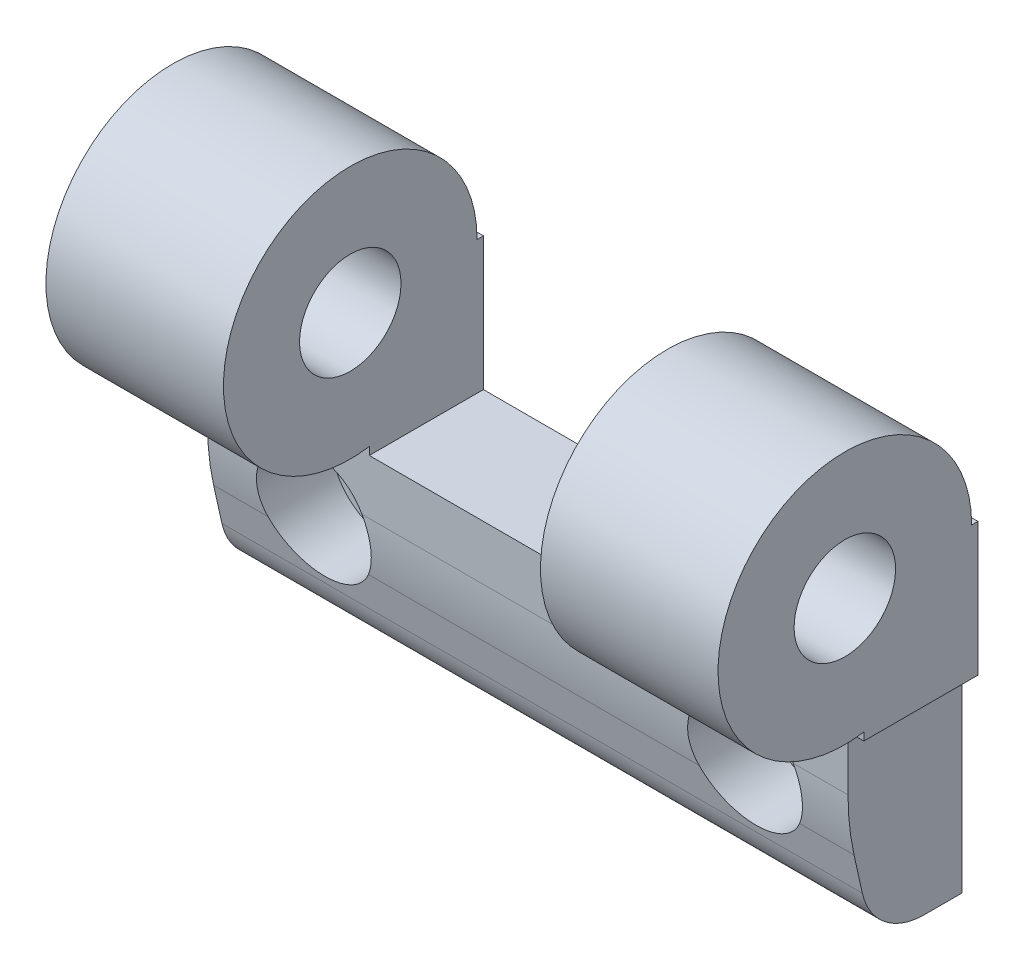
ISO-10303-21;
HEADER;
FILE_DESCRIPTION(('STEP AP214'),'2;1');
FILE_NAME('part.step','',(''),(''),'','','');
FILE_SCHEMA(('AUTOMOTIVE_DESIGN { 1 0 10303 214 1 1 1 1 }'));
ENDSEC;
DATA;
#1=APPLICATION_CONTEXT('core data for automotive mechanical design processes');
#2=APPLICATION_PROTOCOL_DEFINITION('international standard','automotive_design',2000,#1);
#3=PRODUCT_CONTEXT('',#1,'mechanical');
#4=PRODUCT('Part','Part','',(#3));
#5=PRODUCT_RELATED_PRODUCT_CATEGORY('part','',(#4));
#6=PRODUCT_DEFINITION_FORMATION('','',#4);
#7=PRODUCT_DEFINITION_CONTEXT('part definition',#1,'design');
#8=PRODUCT_DEFINITION('design','',#6,#7);
#9=PRODUCT_DEFINITION_SHAPE('','',#8);
#10=(LENGTH_UNIT() NAMED_UNIT(*) SI_UNIT(.MILLI.,.METRE.));
#11=(NAMED_UNIT(*) PLANE_ANGLE_UNIT() SI_UNIT($,.RADIAN.));
#12=(NAMED_UNIT(*) SI_UNIT($,.STERADIAN.) SOLID_ANGLE_UNIT());
#13=UNCERTAINTY_MEASURE_WITH_UNIT(LENGTH_MEASURE(1.E-05),#10,'distance_accuracy_value','');
#14=(GEOMETRIC_REPRESENTATION_CONTEXT(3) GLOBAL_UNCERTAINTY_ASSIGNED_CONTEXT((#13)) GLOBAL_UNIT_ASSIGNED_CONTEXT((#10,
#11,#12)) REPRESENTATION_CONTEXT('',''));
#15=CARTESIAN_POINT('',(0.,0.,0.));
#16=DIRECTION('',(0.,0.,1.));
#17=DIRECTION('',(1.,0.,0.));
#18=AXIS2_PLACEMENT_3D('',#15,#16,#17);
#19=CARTESIAN_POINT('',(-9.5,2.19544457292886,-11.));
#20=DIRECTION('',(1.,0.,0.));
#21=DIRECTION('',(0.,1.,0.));
#22=AXIS2_PLACEMENT_3D('',#19,#20,#21);
#23=CYLINDRICAL_SURFACE('',#22,20.);
#24=CARTESIAN_POINT('',(3.95687320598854,-2.1431645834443,8.52374120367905));
#25=CARTESIAN_POINT('',(4.01660703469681,-2.03290070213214,8.54825287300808));
#26=CARTESIAN_POINT('',(4.07175599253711,-1.92005304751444,8.57234171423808));
#27=CARTESIAN_POINT('',(4.17252019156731,-1.68992066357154,8.6193180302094));
#28=CARTESIAN_POINT('',(4.21813419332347,-1.57263535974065,8.64220534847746));
#29=CARTESIAN_POINT('',(4.29943126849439,-1.33443853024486,8.68640682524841));
#30=CARTESIAN_POINT('',(4.33511861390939,-1.21352858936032,8.70772165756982));
#31=CARTESIAN_POINT('',(4.39627456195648,-0.968849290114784,8.74848394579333));
#32=CARTESIAN_POINT('',(4.42174380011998,-0.845080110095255,8.7679315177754));
#33=CARTESIAN_POINT('',(4.46224845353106,-0.595295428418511,8.804740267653));
#34=CARTESIAN_POINT('',(4.47726432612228,-0.469276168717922,8.82209748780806));
#35=CARTESIAN_POINT('',(4.49659922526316,-0.216123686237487,8.85448616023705));
#36=CARTESIAN_POINT('',(4.5009184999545,-0.0889904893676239,8.86951766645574));
#37=CARTESIAN_POINT('',(4.49875711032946,0.165403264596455,8.89711776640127));
#38=CARTESIAN_POINT('',(4.49228061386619,0.29266375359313,8.90968730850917));
#39=CARTESIAN_POINT('',(4.46852718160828,0.546337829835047,8.93230178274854));
#40=CARTESIAN_POINT('',(4.45125551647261,0.672751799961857,8.94234794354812));
#41=CARTESIAN_POINT('',(4.40665104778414,0.920202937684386,8.95967676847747));
#42=CARTESIAN_POINT('',(4.37962254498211,1.04129006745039,8.96703073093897));
#43=CARTESIAN_POINT('',(4.31562303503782,1.28092962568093,8.97944103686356));
#44=CARTESIAN_POINT('',(4.2786519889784,1.39948204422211,8.98449737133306));
#45=CARTESIAN_POINT('',(4.19490150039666,1.63348536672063,8.99244659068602));
#46=CARTESIAN_POINT('',(4.14809727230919,1.74892758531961,8.99533392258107));
#47=CARTESIAN_POINT('',(4.04507624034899,1.97557342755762,8.99911477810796));
#48=CARTESIAN_POINT('',(3.98885899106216,2.08677685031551,9.00000820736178));
#49=CARTESIAN_POINT('',(3.9281068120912,2.19544457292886,9.));
#50=B_SPLINE_CURVE_WITH_KNOTS('',3,(#24,#25,#26,#27,#28,#29,#30,#31,#32,#33,#34,#35,#36,#37,#38,
#39,#40,#41,#42,#43,#44,#45,#46,#47,#48,#49),.UNSPECIFIED.,.F.,.F.,(4,2,2,2,2,2,2,2,2,2,2,2,4),
(0.,0.383232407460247,0.76651459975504,1.14963158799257,1.53272474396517,1.91653218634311,
2.30033072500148,2.68398112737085,3.06744436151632,3.43985642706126,3.81226995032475,
4.18563369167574,4.55901510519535),.UNSPECIFIED.);
#51=CARTESIAN_POINT('',(3.95687320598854,-2.1431645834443,8.52374120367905));
#52=VERTEX_POINT('',#51);
#53=CARTESIAN_POINT('',(3.9281068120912,2.19544457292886,9.));
#54=VERTEX_POINT('',#53);
#55=EDGE_CURVE('E157',#52,#54,#50,.T.);
#56=ORIENTED_EDGE('',*,*,#55,.F.);
#57=DIRECTION('',(1.,0.,0.));
#58=VECTOR('',#57,1.);
#59=CARTESIAN_POINT('',(-9.5,-2.1431645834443,8.52374120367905));
#60=LINE('',#59,#58);
#61=CARTESIAN_POINT('',(30.0431267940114,-2.1431645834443,8.52374120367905));
#62=VERTEX_POINT('',#61);
#63=EDGE_CURVE('E160',#52,#62,#60,.T.);
#64=ORIENTED_EDGE('',*,*,#63,.T.);
#65=CARTESIAN_POINT('',(30.0718931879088,2.19544457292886,9.));
#66=CARTESIAN_POINT('',(30.0112249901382,2.08692436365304,9.00000772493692));
#67=CARTESIAN_POINT('',(29.9550790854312,1.97587926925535,8.99911700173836));
#68=CARTESIAN_POINT('',(29.8521731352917,1.74955813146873,8.9953472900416));
#69=CARTESIAN_POINT('',(29.8054128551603,1.63428219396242,8.99246835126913));
#70=CARTESIAN_POINT('',(29.7217321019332,1.40063584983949,8.98454182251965));
#71=CARTESIAN_POINT('',(29.6847848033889,1.28227487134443,8.97950024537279));
#72=CARTESIAN_POINT('',(29.6208009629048,1.04305545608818,8.96713248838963));
#73=CARTESIAN_POINT('',(29.5937641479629,0.92219708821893,8.95980637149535));
#74=CARTESIAN_POINT('',(29.5277604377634,0.556948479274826,8.93425805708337));
#75=CARTESIAN_POINT('',(29.5039054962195,0.309899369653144,8.91246636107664));
#76=CARTESIAN_POINT('',(29.496976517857,-0.183901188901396,8.85951756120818));
#77=CARTESIAN_POINT('',(29.5139312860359,-0.430652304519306,8.82835385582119));
#78=CARTESIAN_POINT('',(29.5702101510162,-0.802504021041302,8.77446354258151));
#79=CARTESIAN_POINT('',(29.5953000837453,-0.93034416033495,8.75464210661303));
#80=CARTESIAN_POINT('',(29.656367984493,-1.18310998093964,8.7129841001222));
#81=CARTESIAN_POINT('',(29.6923473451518,-1.30803528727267,8.69114727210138));
#82=CARTESIAN_POINT('',(29.7748952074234,-1.55414052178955,8.64576985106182));
#83=CARTESIAN_POINT('',(29.8214736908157,-1.67531679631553,8.62222766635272));
#84=CARTESIAN_POINT('',(29.9247856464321,-1.91296483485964,8.57385420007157));
#85=CARTESIAN_POINT('',(29.9815171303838,-2.02943751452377,8.54902317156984));
#86=CARTESIAN_POINT('',(30.0431267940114,-2.1431645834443,8.52374120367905));
#87=B_SPLINE_CURVE_WITH_KNOTS('',3,(#65,#66,#67,#68,#69,#70,#71,#72,#73,#74,#75,#76,#77,#78,#79,
#80,#81,#82,#83,#84,#85,#86),.UNSPECIFIED.,.F.,.F.,(4,2,2,2,2,2,2,2,2,2,4),(0.,
0.372866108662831,0.74572289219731,1.11754966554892,1.48936619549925,2.23304529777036,
2.97724947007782,3.37215823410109,3.76711752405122,4.1624503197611,4.55770578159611),.UNSPECIFIED.);
#88=CARTESIAN_POINT('',(30.0718931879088,2.19544457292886,9.));
#89=VERTEX_POINT('',#88);
#90=EDGE_CURVE('E212',#89,#62,#87,.T.);
#91=ORIENTED_EDGE('',*,*,#90,.F.);
#92=DIRECTION('',(1.,0.,0.));
#93=VECTOR('',#92,1.);
#94=CARTESIAN_POINT('',(-9.5,2.19544457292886,9.));
#95=LINE('',#94,#93);
#96=EDGE_CURVE('E36',#54,#89,#95,.T.);
#97=ORIENTED_EDGE('',*,*,#96,.F.);
#98=EDGE_LOOP('',(#56,#64,#91,#97));
#99=FACE_BOUND('',#98,.T.);
#100=ADVANCED_FACE('F14',(#99),#23,.T.);
#101=CARTESIAN_POINT('',(-3.92810681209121,2.19544457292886,9.));
#102=CARTESIAN_POINT('',(-3.98877500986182,2.08692436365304,9.00000772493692));
#103=CARTESIAN_POINT('',(-4.04492091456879,1.97587926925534,8.99911700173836));
#104=CARTESIAN_POINT('',(-4.14782686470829,1.74955813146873,8.9953472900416));
#105=CARTESIAN_POINT('',(-4.19458714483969,1.63428219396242,8.99246835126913));
#106=CARTESIAN_POINT('',(-4.2782678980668,1.40063584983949,8.98454182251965));
#107=CARTESIAN_POINT('',(-4.31521519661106,1.28227487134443,8.97950024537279));
#108=CARTESIAN_POINT('',(-4.37919903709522,1.04305545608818,8.96713248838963));
#109=CARTESIAN_POINT('',(-4.40623585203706,0.922197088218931,8.95980637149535));
#110=CARTESIAN_POINT('',(-4.47223956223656,0.556948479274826,8.93425805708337));
#111=CARTESIAN_POINT('',(-4.4960945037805,0.309899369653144,8.91246636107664));
#112=CARTESIAN_POINT('',(-4.503023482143,-0.183901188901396,8.85951756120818));
#113=CARTESIAN_POINT('',(-4.48606871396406,-0.430652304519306,8.82835385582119));
#114=CARTESIAN_POINT('',(-4.42978984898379,-0.802504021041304,8.77446354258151));
#115=CARTESIAN_POINT('',(-4.40469991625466,-0.930344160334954,8.75464210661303));
#116=CARTESIAN_POINT('',(-4.34363201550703,-1.18310998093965,8.7129841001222));
#117=CARTESIAN_POINT('',(-4.30765265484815,-1.30803528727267,8.69114727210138));
#118=CARTESIAN_POINT('',(-4.2251047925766,-1.55414052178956,8.64576985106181));
#119=CARTESIAN_POINT('',(-4.17852630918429,-1.67531679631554,8.62222766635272));
#120=CARTESIAN_POINT('',(-4.07521435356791,-1.91296483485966,8.57385420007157));
#121=CARTESIAN_POINT('',(-4.01848286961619,-2.02943751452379,8.54902317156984));
#122=CARTESIAN_POINT('',(-3.9568732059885,-2.1431645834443,8.52374120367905));
#123=B_SPLINE_CURVE_WITH_KNOTS('',3,(#101,#102,#103,#104,#105,#106,#107,#108,#109,#110,#111,
#112,#113,#114,#115,#116,#117,#118,#119,#120,#121,#122),.UNSPECIFIED.,.F.,.F.,(4,2,2,2,2,2,2,2,
2,2,4),(0.,0.372866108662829,0.745722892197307,1.11754966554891,1.48936619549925,
2.23304529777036,2.97724947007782,3.3721582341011,3.76711752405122,4.16245031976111,
4.55770578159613),.UNSPECIFIED.);
#124=CARTESIAN_POINT('',(-3.92810681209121,2.19544457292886,9.));
#125=VERTEX_POINT('',#124);
#126=CARTESIAN_POINT('',(-3.9568732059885,-2.1431645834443,8.52374120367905));
#127=VERTEX_POINT('',#126);
#128=EDGE_CURVE('E28',#125,#127,#123,.T.);
#129=ORIENTED_EDGE('',*,*,#128,.F.);
#130=CARTESIAN_POINT('',(-8.25,2.19544457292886,9.));
#131=VERTEX_POINT('',#130);
#132=EDGE_CURVE('E178',#131,#125,#95,.T.);
#133=ORIENTED_EDGE('',*,*,#132,.F.);
#134=CARTESIAN_POINT('',(-8.25,2.19544457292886,-11.));
#135=DIRECTION('',(-1.,0.,0.));
#136=DIRECTION('',(0.,-1.,0.));
#137=AXIS2_PLACEMENT_3D('',#134,#135,#136);
#138=CIRCLE('',#137,20.);
#139=CARTESIAN_POINT('',(-8.25,-2.1431645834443,8.52374120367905));
#140=VERTEX_POINT('',#139);
#141=EDGE_CURVE('E210',#140,#131,#138,.T.);
#142=ORIENTED_EDGE('',*,*,#141,.F.);
#143=EDGE_CURVE('E174',#140,#127,#60,.T.);
#144=ORIENTED_EDGE('',*,*,#143,.T.);
#145=EDGE_LOOP('',(#129,#133,#142,#144));
#146=FACE_BOUND('',#145,.T.);
#147=ADVANCED_FACE('F276',(#146),#23,.T.);
#148=CARTESIAN_POINT('',(37.9568732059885,-2.1431645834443,8.52374120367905));
#149=CARTESIAN_POINT('',(38.0166070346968,-2.03290070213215,8.54825287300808));
#150=CARTESIAN_POINT('',(38.0717559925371,-1.92005304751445,8.57234171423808));
#151=CARTESIAN_POINT('',(38.1725201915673,-1.68992066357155,8.6193180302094));
#152=CARTESIAN_POINT('',(38.2181341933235,-1.57263535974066,8.64220534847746));
#153=CARTESIAN_POINT('',(38.2994312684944,-1.33443853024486,8.68640682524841));
#154=CARTESIAN_POINT('',(38.3351186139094,-1.21352858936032,8.70772165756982));
#155=CARTESIAN_POINT('',(38.3962745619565,-0.968849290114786,8.74848394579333));
#156=CARTESIAN_POINT('',(38.42174380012,-0.845080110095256,8.7679315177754));
#157=CARTESIAN_POINT('',(38.4622484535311,-0.595295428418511,8.804740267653));
#158=CARTESIAN_POINT('',(38.4772643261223,-0.469276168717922,8.82209748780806));
#159=CARTESIAN_POINT('',(38.4965992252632,-0.216123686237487,8.85448616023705));
#160=CARTESIAN_POINT('',(38.5009184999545,-0.0889904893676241,8.86951766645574));
#161=CARTESIAN_POINT('',(38.4987571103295,0.165403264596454,8.89711776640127));
#162=CARTESIAN_POINT('',(38.4922806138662,0.29266375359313,8.90968730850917));
#163=CARTESIAN_POINT('',(38.4685271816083,0.546337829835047,8.93230178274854));
#164=CARTESIAN_POINT('',(38.4512555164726,0.672751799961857,8.94234794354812));
#165=CARTESIAN_POINT('',(38.4066510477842,0.920202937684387,8.95967676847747));
#166=CARTESIAN_POINT('',(38.3796225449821,1.0412900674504,8.96703073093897));
#167=CARTESIAN_POINT('',(38.3156230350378,1.28092962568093,8.97944103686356));
#168=CARTESIAN_POINT('',(38.2786519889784,1.39948204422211,8.98449737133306));
#169=CARTESIAN_POINT('',(38.1949015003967,1.63348536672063,8.99244659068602));
#170=CARTESIAN_POINT('',(38.1480972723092,1.74892758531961,8.99533392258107));
#171=CARTESIAN_POINT('',(38.045076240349,1.97557342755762,8.99911477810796));
#172=CARTESIAN_POINT('',(37.9888589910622,2.08677685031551,9.00000820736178));
#173=CARTESIAN_POINT('',(37.9281068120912,2.19544457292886,9.));
#174=B_SPLINE_CURVE_WITH_KNOTS('',3,(#148,#149,#150,#151,#152,#153,#154,#155,#156,#157,#158,
#159,#160,#161,#162,#163,#164,#165,#166,#167,#168,#169,#170,#171,#172,#173),.UNSPECIFIED.,.F.,
.F.,(4,2,2,2,2,2,2,2,2,2,2,2,4),(0.,0.383232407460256,0.766514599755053,1.14963158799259,
1.53272474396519,1.91653218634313,2.3003307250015,2.68398112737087,3.06744436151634,
3.43985642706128,3.81226995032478,4.18563369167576,4.55901510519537),.UNSPECIFIED.);
#175=CARTESIAN_POINT('',(37.9568732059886,-2.1431645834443,8.52374120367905));
#176=VERTEX_POINT('',#175);
#177=CARTESIAN_POINT('',(37.9281068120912,2.19544457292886,9.));
#178=VERTEX_POINT('',#177);
#179=EDGE_CURVE('E22',#176,#178,#174,.T.);
#180=ORIENTED_EDGE('',*,*,#179,.F.);
#181=CARTESIAN_POINT('',(42.25,-2.1431645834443,8.52374120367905));
#182=VERTEX_POINT('',#181);
#183=EDGE_CURVE('E175',#176,#182,#60,.T.);
#184=ORIENTED_EDGE('',*,*,#183,.T.);
#185=CARTESIAN_POINT('',(42.25,2.19544457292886,-11.));
#186=DIRECTION('',(1.,0.,0.));
#187=DIRECTION('',(0.,1.,0.));
#188=AXIS2_PLACEMENT_3D('',#185,#186,#187);
#189=CIRCLE('',#188,20.);
#190=CARTESIAN_POINT('',(42.25,2.19544457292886,9.));
#191=VERTEX_POINT('',#190);
#192=EDGE_CURVE('E207',#191,#182,#189,.T.);
#193=ORIENTED_EDGE('',*,*,#192,.F.);
#194=EDGE_CURVE('E289',#178,#191,#95,.T.);
#195=ORIENTED_EDGE('',*,*,#194,.F.);
#196=EDGE_LOOP('',(#180,#184,#193,#195));
#197=FACE_BOUND('',#196,.T.);
#198=ADVANCED_FACE('F223',(#197),#23,.T.);
#199=CARTESIAN_POINT('',(-9.5,2.19544457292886,9.));
#200=DIRECTION('',(0.,0.,-1.));
#201=DIRECTION('',(1.,0.,0.));
#202=AXIS2_PLACEMENT_3D('',#199,#200,#201);
#203=PLANE('',#202);
#204=CARTESIAN_POINT('',(0.,0.,9.));
#205=DIRECTION('',(0.,0.,-1.));
#206=DIRECTION('',(1.,0.,0.));
#207=AXIS2_PLACEMENT_3D('',#204,#205,#206);
#208=CIRCLE('',#207,4.5);
#209=EDGE_CURVE('E163',#54,#125,#208,.F.);
#210=ORIENTED_EDGE('',*,*,#209,.F.);
#211=ORIENTED_EDGE('',*,*,#96,.T.);
#212=CARTESIAN_POINT('',(34.,0.,9.));
#213=DIRECTION('',(0.,0.,-1.));
#214=DIRECTION('',(1.,0.,0.));
#215=AXIS2_PLACEMENT_3D('',#212,#213,#214);
#216=CIRCLE('',#215,4.5);
#217=EDGE_CURVE('E291',#178,#89,#216,.F.);
#218=ORIENTED_EDGE('',*,*,#217,.F.);
#219=ORIENTED_EDGE('',*,*,#194,.T.);
#220=DIRECTION('',(0.,-1.,0.));
#221=VECTOR('',#220,1.);
#222=CARTESIAN_POINT('',(42.25,2.19544457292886,9.));
#223=LINE('',#222,#221);
#224=CARTESIAN_POINT('',(42.25,6.5,9.));
#225=VERTEX_POINT('',#224);
#226=EDGE_CURVE('E309',#225,#191,#223,.T.);
#227=ORIENTED_EDGE('',*,*,#226,.F.);
#228=DIRECTION('',(-1.,0.,0.));
#229=VECTOR('',#228,1.);
#230=CARTESIAN_POINT('',(-9.5,6.5,9.));
#231=LINE('',#230,#229);
#232=CARTESIAN_POINT('',(43.5,6.5,9.));
#233=VERTEX_POINT('',#232);
#234=EDGE_CURVE('E304',#233,#225,#231,.T.);
#235=ORIENTED_EDGE('',*,*,#234,.F.);
#236=DIRECTION('',(0.,1.,0.));
#237=VECTOR('',#236,1.);
#238=CARTESIAN_POINT('',(43.5,2.19544457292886,9.));
#239=LINE('',#238,#237);
#240=CARTESIAN_POINT('',(43.5,7.1131400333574,9.));
#241=VERTEX_POINT('',#240);
#242=EDGE_CURVE('E334',#233,#241,#239,.T.);
#243=ORIENTED_EDGE('',*,*,#242,.T.);
#244=DIRECTION('',(1.,0.,0.));
#245=VECTOR('',#244,1.);
#246=CARTESIAN_POINT('',(-9.5,7.1131400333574,9.));
#247=LINE('',#246,#245);
#248=CARTESIAN_POINT('',(29.5,7.1131400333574,9.));
#249=VERTEX_POINT('',#248);
#250=EDGE_CURVE('E198',#249,#241,#247,.T.);
#251=ORIENTED_EDGE('',*,*,#250,.F.);
#252=DIRECTION('',(0.,1.,0.));
#253=VECTOR('',#252,1.);
#254=CARTESIAN_POINT('',(29.5,2.19544457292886,9.));
#255=LINE('',#254,#253);
#256=CARTESIAN_POINT('',(29.5,6.5,9.));
#257=VERTEX_POINT('',#256);
#258=EDGE_CURVE('E324',#257,#249,#255,.T.);
#259=ORIENTED_EDGE('',*,*,#258,.F.);
#260=DIRECTION('',(1.,0.,0.));
#261=VECTOR('',#260,1.);
#262=CARTESIAN_POINT('',(-9.5,6.5,9.));
#263=LINE('',#262,#261);
#264=CARTESIAN_POINT('',(4.5,6.5,9.));
#265=VERTEX_POINT('',#264);
#266=EDGE_CURVE('E332',#265,#257,#263,.T.);
#267=ORIENTED_EDGE('',*,*,#266,.F.);
#268=DIRECTION('',(0.,-1.,0.));
#269=VECTOR('',#268,1.);
#270=CARTESIAN_POINT('',(4.5,2.19544457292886,9.));
#271=LINE('',#270,#269);
#272=CARTESIAN_POINT('',(4.5,7.1131400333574,9.));
#273=VERTEX_POINT('',#272);
#274=EDGE_CURVE('E330',#273,#265,#271,.T.);
#275=ORIENTED_EDGE('',*,*,#274,.F.);
#276=CARTESIAN_POINT('',(-9.5,7.1131400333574,9.));
#277=VERTEX_POINT('',#276);
#278=EDGE_CURVE('E199',#277,#273,#247,.T.);
#279=ORIENTED_EDGE('',*,*,#278,.F.);
#280=DIRECTION('',(0.,1.,0.));
#281=VECTOR('',#280,1.);
#282=CARTESIAN_POINT('',(-9.5,2.19544457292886,9.));
#283=LINE('',#282,#281);
#284=CARTESIAN_POINT('',(-9.5,6.5,9.));
#285=VERTEX_POINT('',#284);
#286=EDGE_CURVE('E335',#285,#277,#283,.T.);
#287=ORIENTED_EDGE('',*,*,#286,.F.);
#288=DIRECTION('',(-1.,0.,0.));
#289=VECTOR('',#288,1.);
#290=CARTESIAN_POINT('',(-9.5,6.5,9.));
#291=LINE('',#290,#289);
#292=CARTESIAN_POINT('',(-8.25,6.5,9.));
#293=VERTEX_POINT('',#292);
#294=EDGE_CURVE('E300',#293,#285,#291,.T.);
#295=ORIENTED_EDGE('',*,*,#294,.F.);
#296=DIRECTION('',(0.,1.,0.));
#297=VECTOR('',#296,1.);
#298=CARTESIAN_POINT('',(-8.25,2.19544457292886,9.));
#299=LINE('',#298,#297);
#300=EDGE_CURVE('E318',#131,#293,#299,.T.);
#301=ORIENTED_EDGE('',*,*,#300,.F.);
#302=ORIENTED_EDGE('',*,*,#132,.T.);
#303=EDGE_LOOP('',(#210,#211,#218,#219,#227,#235,#243,#251,#259,#267,#275,#279,#287,#295,#301,#302));
#304=FACE_BOUND('',#303,.T.);
#305=ADVANCED_FACE('F16',(#304),#203,.F.);
#306=CARTESIAN_POINT('',(-9.5,17.,10.5));
#307=DIRECTION('',(1.,0.,0.));
#308=DIRECTION('',(0.,1.,0.));
#309=AXIS2_PLACEMENT_3D('',#306,#307,#308);
#310=CYLINDRICAL_SURFACE('',#309,10.);
#311=CARTESIAN_POINT('',(4.5,17.,10.5));
#312=DIRECTION('',(1.,0.,0.));
#313=DIRECTION('',(0.,1.,0.));
#314=AXIS2_PLACEMENT_3D('',#311,#312,#313);
#315=CIRCLE('',#314,10.);
#316=CARTESIAN_POINT('',(4.5,17.,0.5));
#317=VERTEX_POINT('',#316);
#318=EDGE_CURVE('E328',#317,#273,#315,.T.);
#319=ORIENTED_EDGE('',*,*,#318,.F.);
#320=DIRECTION('',(1.,0.,0.));
#321=VECTOR('',#320,1.);
#322=CARTESIAN_POINT('',(-9.5,17.,0.5));
#323=LINE('',#322,#321);
#324=CARTESIAN_POINT('',(-9.5,17.,0.5));
#325=VERTEX_POINT('',#324);
#326=EDGE_CURVE('E195',#325,#317,#323,.T.);
#327=ORIENTED_EDGE('',*,*,#326,.F.);
#328=CARTESIAN_POINT('',(-9.5,17.,10.5));
#329=DIRECTION('',(-1.,0.,0.));
#330=DIRECTION('',(0.,-1.,0.));
#331=AXIS2_PLACEMENT_3D('',#328,#329,#330);
#332=CIRCLE('',#331,10.);
#333=EDGE_CURVE('E337',#277,#325,#332,.T.);
#334=ORIENTED_EDGE('',*,*,#333,.F.);
#335=ORIENTED_EDGE('',*,*,#278,.T.);
#336=EDGE_LOOP('',(#319,#327,#334,#335));
#337=FACE_BOUND('',#336,.T.);
#338=ADVANCED_FACE('F286',(#337),#310,.T.);
#339=CARTESIAN_POINT('',(29.5,17.,10.5));
#340=DIRECTION('',(-1.,0.,0.));
#341=DIRECTION('',(0.,-1.,0.));
#342=AXIS2_PLACEMENT_3D('',#339,#340,#341);
#343=CIRCLE('',#342,10.);
#344=CARTESIAN_POINT('',(29.5,17.,0.5));
#345=VERTEX_POINT('',#344);
#346=EDGE_CURVE('E322',#249,#345,#343,.T.);
#347=ORIENTED_EDGE('',*,*,#346,.F.);
#348=ORIENTED_EDGE('',*,*,#250,.T.);
#349=CARTESIAN_POINT('',(43.5,17.,10.5));
#350=DIRECTION('',(-1.,0.,0.));
#351=DIRECTION('',(0.,-1.,0.));
#352=AXIS2_PLACEMENT_3D('',#349,#350,#351);
#353=CIRCLE('',#352,10.);
#354=CARTESIAN_POINT('',(43.5,17.,0.5));
#355=VERTEX_POINT('',#354);
#356=EDGE_CURVE('E347',#241,#355,#353,.T.);
#357=ORIENTED_EDGE('',*,*,#356,.T.);
#358=EDGE_CURVE('E194',#345,#355,#323,.T.);
#359=ORIENTED_EDGE('',*,*,#358,.F.);
#360=EDGE_LOOP('',(#347,#348,#357,#359));
#361=FACE_BOUND('',#360,.T.);
#362=ADVANCED_FACE('F451',(#361),#310,.T.);
#363=CARTESIAN_POINT('',(-9.5,17.,0.5));
#364=DIRECTION('',(0.,-1.,0.));
#365=DIRECTION('',(1.,0.,0.));
#366=AXIS2_PLACEMENT_3D('',#363,#364,#365);
#367=PLANE('',#366);
#368=DIRECTION('',(0.,0.,1.));
#369=VECTOR('',#368,1.);
#370=CARTESIAN_POINT('',(4.5,17.,0.5));
#371=LINE('',#370,#369);
#372=CARTESIAN_POINT('',(4.5,17.,0.));
#373=VERTEX_POINT('',#372);
#374=EDGE_CURVE('E326',#373,#317,#371,.T.);
#375=ORIENTED_EDGE('',*,*,#374,.F.);
#376=DIRECTION('',(1.,0.,0.));
#377=VECTOR('',#376,1.);
#378=CARTESIAN_POINT('',(-9.5,17.,0.));
#379=LINE('',#378,#377);
#380=CARTESIAN_POINT('',(-9.5,17.,0.));
#381=VERTEX_POINT('',#380);
#382=EDGE_CURVE('E191',#381,#373,#379,.T.);
#383=ORIENTED_EDGE('',*,*,#382,.F.);
#384=DIRECTION('',(0.,0.,-1.));
#385=VECTOR('',#384,1.);
#386=CARTESIAN_POINT('',(-9.5,17.,0.5));
#387=LINE('',#386,#385);
#388=EDGE_CURVE('E340',#325,#381,#387,.T.);
#389=ORIENTED_EDGE('',*,*,#388,.F.);
#390=ORIENTED_EDGE('',*,*,#326,.T.);
#391=EDGE_LOOP('',(#375,#383,#389,#390));
#392=FACE_BOUND('',#391,.T.);
#393=ADVANCED_FACE('F445',(#392),#367,.F.);
#394=DIRECTION('',(0.,0.,-1.));
#395=VECTOR('',#394,1.);
#396=CARTESIAN_POINT('',(29.5,17.,0.5));
#397=LINE('',#396,#395);
#398=CARTESIAN_POINT('',(29.5,17.,0.));
#399=VERTEX_POINT('',#398);
#400=EDGE_CURVE('E320',#345,#399,#397,.T.);
#401=ORIENTED_EDGE('',*,*,#400,.F.);
#402=ORIENTED_EDGE('',*,*,#358,.T.);
#403=DIRECTION('',(0.,0.,-1.));
#404=VECTOR('',#403,1.);
#405=CARTESIAN_POINT('',(43.5,17.,0.5));
#406=LINE('',#405,#404);
#407=CARTESIAN_POINT('',(43.5,17.,0.));
#408=VERTEX_POINT('',#407);
#409=EDGE_CURVE('E350',#355,#408,#406,.T.);
#410=ORIENTED_EDGE('',*,*,#409,.T.);
#411=EDGE_CURVE('E190',#399,#408,#379,.T.);
#412=ORIENTED_EDGE('',*,*,#411,.F.);
#413=EDGE_LOOP('',(#401,#402,#410,#412));
#414=FACE_BOUND('',#413,.T.);
#415=ADVANCED_FACE('F435',(#414),#367,.F.);
#416=CARTESIAN_POINT('',(-9.5,17.,0.));
#417=DIRECTION('',(0.,0.,1.));
#418=DIRECTION('',(-1.,0.,0.));
#419=AXIS2_PLACEMENT_3D('',#416,#417,#418);
#420=PLANE('',#419);
#421=CARTESIAN_POINT('',(0.,0.,0.));
#422=DIRECTION('',(0.,0.,-1.));
#423=DIRECTION('',(1.,0.,0.));
#424=AXIS2_PLACEMENT_3D('',#421,#422,#423);
#425=CIRCLE('',#424,2.6);
#426=CARTESIAN_POINT('',(2.6,0.,0.));
#427=VERTEX_POINT('',#426);
#428=EDGE_CURVE('E638',#427,#427,#425,.T.);
#429=ORIENTED_EDGE('',*,*,#428,.F.);
#430=EDGE_LOOP('',(#429));
#431=FACE_BOUND('',#430,.T.);
#432=CARTESIAN_POINT('',(34.,0.,0.));
#433=DIRECTION('',(0.,0.,-1.));
#434=DIRECTION('',(1.,0.,0.));
#435=AXIS2_PLACEMENT_3D('',#432,#433,#434);
#436=CIRCLE('',#435,2.6);
#437=CARTESIAN_POINT('',(36.6,0.,0.));
#438=VERTEX_POINT('',#437);
#439=EDGE_CURVE('E162',#438,#438,#436,.T.);
#440=ORIENTED_EDGE('',*,*,#439,.F.);
#441=EDGE_LOOP('',(#440));
#442=FACE_BOUND('',#441,.T.);
#443=DIRECTION('',(0.,1.,0.));
#444=VECTOR('',#443,1.);
#445=CARTESIAN_POINT('',(-8.25,-13.,0.));
#446=LINE('',#445,#444);
#447=CARTESIAN_POINT('',(-8.25,-9.,0.));
#448=VERTEX_POINT('',#447);
#449=CARTESIAN_POINT('',(-8.25,6.5,0.));
#450=VERTEX_POINT('',#449);
#451=EDGE_CURVE('E392',#448,#450,#446,.T.);
#452=ORIENTED_EDGE('',*,*,#451,.T.);
#453=DIRECTION('',(-1.,0.,0.));
#454=VECTOR('',#453,1.);
#455=CARTESIAN_POINT('',(-8.25,6.5,0.));
#456=LINE('',#455,#454);
#457=CARTESIAN_POINT('',(-9.5,6.5,0.));
#458=VERTEX_POINT('',#457);
#459=EDGE_CURVE('E389',#450,#458,#456,.T.);
#460=ORIENTED_EDGE('',*,*,#459,.T.);
#461=DIRECTION('',(0.,-1.,0.));
#462=VECTOR('',#461,1.);
#463=CARTESIAN_POINT('',(-9.5,17.,0.));
#464=LINE('',#463,#462);
#465=EDGE_CURVE('E342',#381,#458,#464,.T.);
#466=ORIENTED_EDGE('',*,*,#465,.F.);
#467=ORIENTED_EDGE('',*,*,#382,.T.);
#468=DIRECTION('',(0.,-1.,0.));
#469=VECTOR('',#468,1.);
#470=CARTESIAN_POINT('',(4.5,27.5,0.));
#471=LINE('',#470,#469);
#472=CARTESIAN_POINT('',(4.5,6.5,0.));
#473=VERTEX_POINT('',#472);
#474=EDGE_CURVE('E386',#373,#473,#471,.T.);
#475=ORIENTED_EDGE('',*,*,#474,.T.);
#476=DIRECTION('',(1.,0.,0.));
#477=VECTOR('',#476,1.);
#478=CARTESIAN_POINT('',(4.5,6.5,0.));
#479=LINE('',#478,#477);
#480=CARTESIAN_POINT('',(29.5,6.5,0.));
#481=VERTEX_POINT('',#480);
#482=EDGE_CURVE('E383',#473,#481,#479,.T.);
#483=ORIENTED_EDGE('',*,*,#482,.T.);
#484=DIRECTION('',(0.,1.,0.));
#485=VECTOR('',#484,1.);
#486=CARTESIAN_POINT('',(29.5,6.5,0.));
#487=LINE('',#486,#485);
#488=EDGE_CURVE('E381',#481,#399,#487,.T.);
#489=ORIENTED_EDGE('',*,*,#488,.T.);
#490=ORIENTED_EDGE('',*,*,#411,.T.);
#491=DIRECTION('',(0.,-1.,0.));
#492=VECTOR('',#491,1.);
#493=CARTESIAN_POINT('',(43.5,17.,0.));
#494=LINE('',#493,#492);
#495=CARTESIAN_POINT('',(43.5,6.5,0.));
#496=VERTEX_POINT('',#495);
#497=EDGE_CURVE('E338',#408,#496,#494,.T.);
#498=ORIENTED_EDGE('',*,*,#497,.T.);
#499=DIRECTION('',(-1.,0.,0.));
#500=VECTOR('',#499,1.);
#501=CARTESIAN_POINT('',(47.25,6.5,0.));
#502=LINE('',#501,#500);
#503=CARTESIAN_POINT('',(42.25,6.5,0.));
#504=VERTEX_POINT('',#503);
#505=EDGE_CURVE('E359',#496,#504,#502,.T.);
#506=ORIENTED_EDGE('',*,*,#505,.T.);
#507=DIRECTION('',(0.,-1.,0.));
#508=VECTOR('',#507,1.);
#509=CARTESIAN_POINT('',(42.25,6.5,0.));
#510=LINE('',#509,#508);
#511=CARTESIAN_POINT('',(42.25,-9.,0.));
#512=VERTEX_POINT('',#511);
#513=EDGE_CURVE('E378',#504,#512,#510,.T.);
#514=ORIENTED_EDGE('',*,*,#513,.T.);
#515=DIRECTION('',(1.,0.,0.));
#516=VECTOR('',#515,1.);
#517=CARTESIAN_POINT('',(-9.5,-9.,0.));
#518=LINE('',#517,#516);
#519=EDGE_CURVE('E187',#448,#512,#518,.T.);
#520=ORIENTED_EDGE('',*,*,#519,.F.);
#521=EDGE_LOOP('',(#452,#460,#466,#467,#475,#483,#489,#490,#498,#506,#514,#520));
#522=FACE_BOUND('',#521,.T.);
#523=ADVANCED_FACE('F357',(#431,#442,#522),#420,.F.);
#524=CARTESIAN_POINT('',(-9.5,-9.,0.));
#525=DIRECTION('',(0.,1.,0.));
#526=DIRECTION('',(-1.,0.,0.));
#527=AXIS2_PLACEMENT_3D('',#524,#525,#526);
#528=PLANE('',#527);
#529=DIRECTION('',(0.,0.,1.));
#530=VECTOR('',#529,1.);
#531=CARTESIAN_POINT('',(-8.25,-9.,0.));
#532=LINE('',#531,#530);
#533=CARTESIAN_POINT('',(-8.25,-9.,2.98914196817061));
#534=VERTEX_POINT('',#533);
#535=EDGE_CURVE('E316',#448,#534,#532,.T.);
#536=ORIENTED_EDGE('',*,*,#535,.F.);
#537=ORIENTED_EDGE('',*,*,#519,.T.);
#538=DIRECTION('',(0.,0.,-1.));
#539=VECTOR('',#538,1.);
#540=CARTESIAN_POINT('',(42.25,-9.,0.));
#541=LINE('',#540,#539);
#542=CARTESIAN_POINT('',(42.25,-9.,2.98914196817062));
#543=VERTEX_POINT('',#542);
#544=EDGE_CURVE('E302',#543,#512,#541,.T.);
#545=ORIENTED_EDGE('',*,*,#544,.F.);
#546=DIRECTION('',(1.,0.,0.));
#547=VECTOR('',#546,1.);
#548=CARTESIAN_POINT('',(-9.5,-9.,2.98914196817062));
#549=LINE('',#548,#547);
#550=EDGE_CURVE('E184',#534,#543,#549,.T.);
#551=ORIENTED_EDGE('',*,*,#550,.F.);
#552=EDGE_LOOP('',(#536,#537,#545,#551));
#553=FACE_BOUND('',#552,.T.);
#554=ADVANCED_FACE('F434',(#553),#528,.F.);
#555=CARTESIAN_POINT('',(-9.5,-4.,2.98914196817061));
#556=DIRECTION('',(1.,0.,0.));
#557=DIRECTION('',(0.,1.,0.));
#558=AXIS2_PLACEMENT_3D('',#555,#556,#557);
#559=CYLINDRICAL_SURFACE('',#558,5.);
#560=CARTESIAN_POINT('',(-8.25,-4.,2.98914196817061));
#561=DIRECTION('',(-1.,0.,0.));
#562=DIRECTION('',(0.,-1.,0.));
#563=AXIS2_PLACEMENT_3D('',#560,#561,#562);
#564=CIRCLE('',#563,5.);
#565=CARTESIAN_POINT('',(-8.25,-5.0846522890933,7.87007726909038));
#566=VERTEX_POINT('',#565);
#567=EDGE_CURVE('E314',#534,#566,#564,.T.);
#568=ORIENTED_EDGE('',*,*,#567,.F.);
#569=ORIENTED_EDGE('',*,*,#550,.T.);
#570=CARTESIAN_POINT('',(42.25,-4.,2.98914196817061));
#571=DIRECTION('',(1.,0.,0.));
#572=DIRECTION('',(0.,1.,0.));
#573=AXIS2_PLACEMENT_3D('',#570,#571,#572);
#574=CIRCLE('',#573,5.);
#575=CARTESIAN_POINT('',(42.25,-5.0846522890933,7.87007726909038));
#576=VERTEX_POINT('',#575);
#577=EDGE_CURVE('E299',#576,#543,#574,.T.);
#578=ORIENTED_EDGE('',*,*,#577,.F.);
#579=DIRECTION('',(1.,0.,0.));
#580=VECTOR('',#579,1.);
#581=CARTESIAN_POINT('',(-9.5,-5.0846522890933,7.87007726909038));
#582=LINE('',#581,#580);
#583=EDGE_CURVE('E177',#566,#576,#582,.T.);
#584=ORIENTED_EDGE('',*,*,#583,.F.);
#585=EDGE_LOOP('',(#568,#569,#578,#584));
#586=FACE_BOUND('',#585,.T.);
#587=ADVANCED_FACE('F442',(#586),#559,.T.);
#588=CARTESIAN_POINT('',(-9.5,-5.0846522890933,7.87007726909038));
#589=DIRECTION('',(0.,0.216930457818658,-0.976187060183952));
#590=DIRECTION('',(0.,-0.976187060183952,-0.216930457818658));
#591=AXIS2_PLACEMENT_3D('',#588,#589,#590);
#592=PLANE('',#591);
#593=CARTESIAN_POINT('',(0.,0.,9.));
#594=DIRECTION('',(0.,0.216930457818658,-0.976187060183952));
#595=DIRECTION('',(0.,-0.976187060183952,-0.216930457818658));
#596=AXIS2_PLACEMENT_3D('',#593,#594,#595);
#597=ELLIPSE('',#596,4.60977222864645,4.5);
#598=EDGE_CURVE('E9',#127,#52,#597,.F.);
#599=ORIENTED_EDGE('',*,*,#598,.F.);
#600=ORIENTED_EDGE('',*,*,#143,.F.);
#601=DIRECTION('',(0.,0.976187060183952,0.216930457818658));
#602=VECTOR('',#601,1.);
#603=CARTESIAN_POINT('',(-8.25,-5.0846522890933,7.87007726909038));
#604=LINE('',#603,#602);
#605=EDGE_CURVE('E312',#566,#140,#604,.T.);
#606=ORIENTED_EDGE('',*,*,#605,.F.);
#607=ORIENTED_EDGE('',*,*,#583,.T.);
#608=DIRECTION('',(0.,-0.976187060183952,-0.216930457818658));
#609=VECTOR('',#608,1.);
#610=CARTESIAN_POINT('',(42.25,-5.0846522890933,7.87007726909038));
#611=LINE('',#610,#609);
#612=EDGE_CURVE('E295',#182,#576,#611,.T.);
#613=ORIENTED_EDGE('',*,*,#612,.F.);
#614=ORIENTED_EDGE('',*,*,#183,.F.);
#615=CARTESIAN_POINT('',(34.,0.,9.));
#616=DIRECTION('',(0.,0.216930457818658,-0.976187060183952));
#617=DIRECTION('',(0.,-0.976187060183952,-0.216930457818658));
#618=AXIS2_PLACEMENT_3D('',#615,#616,#617);
#619=ELLIPSE('',#618,4.60977222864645,4.5);
#620=EDGE_CURVE('E173',#62,#176,#619,.F.);
#621=ORIENTED_EDGE('',*,*,#620,.F.);
#622=ORIENTED_EDGE('',*,*,#63,.F.);
#623=EDGE_LOOP('',(#599,#600,#606,#607,#613,#614,#621,#622));
#624=FACE_BOUND('',#623,.T.);
#625=ADVANCED_FACE('F170',(#624),#592,.F.);
#626=CARTESIAN_POINT('',(-9.5,17.,10.5));
#627=DIRECTION('',(-1.,0.,0.));
#628=DIRECTION('',(0.,-1.,0.));
#629=AXIS2_PLACEMENT_3D('',#626,#627,#628);
#630=PLANE('',#629);
#631=ORIENTED_EDGE('',*,*,#465,.T.);
#632=DIRECTION('',(0.,0.,1.));
#633=VECTOR('',#632,1.);
#634=CARTESIAN_POINT('',(-9.5,6.5,10.5));
#635=LINE('',#634,#633);
#636=EDGE_CURVE('E204',#458,#285,#635,.T.);
#637=ORIENTED_EDGE('',*,*,#636,.T.);
#638=ORIENTED_EDGE('',*,*,#286,.T.);
#639=ORIENTED_EDGE('',*,*,#333,.T.);
#640=ORIENTED_EDGE('',*,*,#388,.T.);
#641=EDGE_LOOP('',(#631,#637,#638,#639,#640));
#642=FACE_BOUND('',#641,.T.);
#643=CARTESIAN_POINT('',(-9.5,17.,10.5));
#644=DIRECTION('',(-1.,0.,0.));
#645=DIRECTION('',(0.,-1.,0.));
#646=AXIS2_PLACEMENT_3D('',#643,#644,#645);
#647=CIRCLE('',#646,4.);
#648=CARTESIAN_POINT('',(-9.5,13.,10.5));
#649=VERTEX_POINT('',#648);
#650=EDGE_CURVE('E629',#649,#649,#647,.T.);
#651=ORIENTED_EDGE('',*,*,#650,.F.);
#652=EDGE_LOOP('',(#651));
#653=FACE_BOUND('',#652,.T.);
#654=ADVANCED_FACE('F265',(#642,#653),#630,.T.);
#655=CARTESIAN_POINT('',(43.5,17.,10.5));
#656=DIRECTION('',(-1.,0.,0.));
#657=DIRECTION('',(0.,-1.,0.));
#658=AXIS2_PLACEMENT_3D('',#655,#656,#657);
#659=PLANE('',#658);
#660=DIRECTION('',(0.,0.,1.));
#661=VECTOR('',#660,1.);
#662=CARTESIAN_POINT('',(43.5,6.5,10.5));
#663=LINE('',#662,#661);
#664=EDGE_CURVE('E202',#496,#233,#663,.T.);
#665=ORIENTED_EDGE('',*,*,#664,.F.);
#666=ORIENTED_EDGE('',*,*,#497,.F.);
#667=ORIENTED_EDGE('',*,*,#409,.F.);
#668=ORIENTED_EDGE('',*,*,#356,.F.);
#669=ORIENTED_EDGE('',*,*,#242,.F.);
#670=EDGE_LOOP('',(#665,#666,#667,#668,#669));
#671=FACE_BOUND('',#670,.T.);
#672=CARTESIAN_POINT('',(43.5,17.,10.5));
#673=DIRECTION('',(1.,0.,0.));
#674=DIRECTION('',(0.,1.,0.));
#675=AXIS2_PLACEMENT_3D('',#672,#673,#674);
#676=CIRCLE('',#675,4.);
#677=CARTESIAN_POINT('',(43.5,21.,10.5));
#678=VERTEX_POINT('',#677);
#679=EDGE_CURVE('E624',#678,#678,#676,.T.);
#680=ORIENTED_EDGE('',*,*,#679,.F.);
#681=EDGE_LOOP('',(#680));
#682=FACE_BOUND('',#681,.T.);
#683=ADVANCED_FACE('F245',(#671,#682),#659,.F.);
#684=CARTESIAN_POINT('',(47.25,6.5,53.));
#685=DIRECTION('',(0.,-1.,0.));
#686=DIRECTION('',(1.,0.,0.));
#687=AXIS2_PLACEMENT_3D('',#684,#685,#686);
#688=PLANE('',#687);
#689=ORIENTED_EDGE('',*,*,#234,.T.);
#690=DIRECTION('',(0.,0.,-1.));
#691=VECTOR('',#690,1.);
#692=CARTESIAN_POINT('',(42.25,6.5,53.));
#693=LINE('',#692,#691);
#694=EDGE_CURVE('E376',#225,#504,#693,.T.);
#695=ORIENTED_EDGE('',*,*,#694,.T.);
#696=ORIENTED_EDGE('',*,*,#505,.F.);
#697=ORIENTED_EDGE('',*,*,#664,.T.);
#698=EDGE_LOOP('',(#689,#695,#696,#697));
#699=FACE_BOUND('',#698,.T.);
#700=ADVANCED_FACE('F241',(#699),#688,.T.);
#701=CARTESIAN_POINT('',(42.25,6.5,53.));
#702=DIRECTION('',(1.,0.,0.));
#703=DIRECTION('',(0.,1.,0.));
#704=AXIS2_PLACEMENT_3D('',#701,#702,#703);
#705=PLANE('',#704);
#706=ORIENTED_EDGE('',*,*,#226,.T.);
#707=ORIENTED_EDGE('',*,*,#192,.T.);
#708=ORIENTED_EDGE('',*,*,#612,.T.);
#709=ORIENTED_EDGE('',*,*,#577,.T.);
#710=ORIENTED_EDGE('',*,*,#544,.T.);
#711=ORIENTED_EDGE('',*,*,#513,.F.);
#712=ORIENTED_EDGE('',*,*,#694,.F.);
#713=EDGE_LOOP('',(#706,#707,#708,#709,#710,#711,#712));
#714=FACE_BOUND('',#713,.T.);
#715=ADVANCED_FACE('F236',(#714),#705,.T.);
#716=CARTESIAN_POINT('',(-8.25,6.5,53.));
#717=DIRECTION('',(0.,-1.,0.));
#718=DIRECTION('',(1.,0.,0.));
#719=AXIS2_PLACEMENT_3D('',#716,#717,#718);
#720=PLANE('',#719);
#721=ORIENTED_EDGE('',*,*,#294,.T.);
#722=ORIENTED_EDGE('',*,*,#636,.F.);
#723=ORIENTED_EDGE('',*,*,#459,.F.);
#724=DIRECTION('',(0.,0.,-1.));
#725=VECTOR('',#724,1.);
#726=CARTESIAN_POINT('',(-8.25,6.5,53.));
#727=LINE('',#726,#725);
#728=EDGE_CURVE('E369',#293,#450,#727,.T.);
#729=ORIENTED_EDGE('',*,*,#728,.F.);
#730=EDGE_LOOP('',(#721,#722,#723,#729));
#731=FACE_BOUND('',#730,.T.);
#732=ADVANCED_FACE('F240',(#731),#720,.T.);
#733=CARTESIAN_POINT('',(-8.25,-13.,53.));
#734=DIRECTION('',(-1.,0.,0.));
#735=DIRECTION('',(0.,-1.,0.));
#736=AXIS2_PLACEMENT_3D('',#733,#734,#735);
#737=PLANE('',#736);
#738=ORIENTED_EDGE('',*,*,#300,.T.);
#739=ORIENTED_EDGE('',*,*,#728,.T.);
#740=ORIENTED_EDGE('',*,*,#451,.F.);
#741=ORIENTED_EDGE('',*,*,#535,.T.);
#742=ORIENTED_EDGE('',*,*,#567,.T.);
#743=ORIENTED_EDGE('',*,*,#605,.T.);
#744=ORIENTED_EDGE('',*,*,#141,.T.);
#745=EDGE_LOOP('',(#738,#739,#740,#741,#742,#743,#744));
#746=FACE_BOUND('',#745,.T.);
#747=ADVANCED_FACE('F254',(#746),#737,.T.);
#748=CARTESIAN_POINT('',(4.5,6.5,53.));
#749=DIRECTION('',(0.,1.,0.));
#750=DIRECTION('',(-1.,0.,0.));
#751=AXIS2_PLACEMENT_3D('',#748,#749,#750);
#752=PLANE('',#751);
#753=ORIENTED_EDGE('',*,*,#266,.T.);
#754=DIRECTION('',(0.,0.,-1.));
#755=VECTOR('',#754,1.);
#756=CARTESIAN_POINT('',(29.5,6.5,53.));
#757=LINE('',#756,#755);
#758=EDGE_CURVE('E374',#257,#481,#757,.T.);
#759=ORIENTED_EDGE('',*,*,#758,.T.);
#760=ORIENTED_EDGE('',*,*,#482,.F.);
#761=DIRECTION('',(0.,0.,-1.));
#762=VECTOR('',#761,1.);
#763=CARTESIAN_POINT('',(4.5,6.5,53.));
#764=LINE('',#763,#762);
#765=EDGE_CURVE('E370',#265,#473,#764,.T.);
#766=ORIENTED_EDGE('',*,*,#765,.F.);
#767=EDGE_LOOP('',(#753,#759,#760,#766));
#768=FACE_BOUND('',#767,.T.);
#769=ADVANCED_FACE('F251',(#768),#752,.T.);
#770=CARTESIAN_POINT('',(4.5,27.5,53.));
#771=DIRECTION('',(1.,0.,0.));
#772=DIRECTION('',(0.,1.,0.));
#773=AXIS2_PLACEMENT_3D('',#770,#771,#772);
#774=PLANE('',#773);
#775=ORIENTED_EDGE('',*,*,#274,.T.);
#776=ORIENTED_EDGE('',*,*,#765,.T.);
#777=ORIENTED_EDGE('',*,*,#474,.F.);
#778=ORIENTED_EDGE('',*,*,#374,.T.);
#779=ORIENTED_EDGE('',*,*,#318,.T.);
#780=EDGE_LOOP('',(#775,#776,#777,#778,#779));
#781=FACE_BOUND('',#780,.T.);
#782=CARTESIAN_POINT('',(4.5,17.,10.5));
#783=DIRECTION('',(1.,0.,0.));
#784=DIRECTION('',(0.,1.,0.));
#785=AXIS2_PLACEMENT_3D('',#782,#783,#784);
#786=CIRCLE('',#785,4.);
#787=CARTESIAN_POINT('',(4.5,21.,10.5));
#788=VERTEX_POINT('',#787);
#789=EDGE_CURVE('E632',#788,#788,#786,.F.);
#790=ORIENTED_EDGE('',*,*,#789,.T.);
#791=EDGE_LOOP('',(#790));
#792=FACE_BOUND('',#791,.T.);
#793=ADVANCED_FACE('F249',(#781,#792),#774,.T.);
#794=CARTESIAN_POINT('',(29.5,6.5,53.));
#795=DIRECTION('',(-1.,0.,0.));
#796=DIRECTION('',(0.,-1.,0.));
#797=AXIS2_PLACEMENT_3D('',#794,#795,#796);
#798=PLANE('',#797);
#799=ORIENTED_EDGE('',*,*,#258,.T.);
#800=ORIENTED_EDGE('',*,*,#346,.T.);
#801=ORIENTED_EDGE('',*,*,#400,.T.);
#802=ORIENTED_EDGE('',*,*,#488,.F.);
#803=ORIENTED_EDGE('',*,*,#758,.F.);
#804=EDGE_LOOP('',(#799,#800,#801,#802,#803));
#805=FACE_BOUND('',#804,.T.);
#806=CARTESIAN_POINT('',(29.5,17.,10.5));
#807=DIRECTION('',(-1.,0.,0.));
#808=DIRECTION('',(0.,-1.,0.));
#809=AXIS2_PLACEMENT_3D('',#806,#807,#808);
#810=CIRCLE('',#809,4.);
#811=CARTESIAN_POINT('',(29.5,13.,10.5));
#812=VERTEX_POINT('',#811);
#813=EDGE_CURVE('E627',#812,#812,#810,.F.);
#814=ORIENTED_EDGE('',*,*,#813,.T.);
#815=EDGE_LOOP('',(#814));
#816=FACE_BOUND('',#815,.T.);
#817=ADVANCED_FACE('F233',(#805,#816),#798,.T.);
#818=CARTESIAN_POINT('',(34.,0.,0.));
#819=DIRECTION('',(0.,0.,-1.));
#820=DIRECTION('',(1.,0.,0.));
#821=AXIS2_PLACEMENT_3D('',#818,#819,#820);
#822=CYLINDRICAL_SURFACE('',#821,4.5);
#823=CARTESIAN_POINT('',(34.,0.,3.));
#824=DIRECTION('',(0.,0.,-1.));
#825=DIRECTION('',(1.,0.,0.));
#826=AXIS2_PLACEMENT_3D('',#823,#824,#825);
#827=CIRCLE('',#826,4.5);
#828=CARTESIAN_POINT('',(38.5,0.,3.));
#829=VERTEX_POINT('',#828);
#830=EDGE_CURVE('E292',#829,#829,#827,.T.);
#831=ORIENTED_EDGE('',*,*,#830,.T.);
#832=EDGE_LOOP('',(#831));
#833=FACE_BOUND('',#832,.T.);
#834=ORIENTED_EDGE('',*,*,#620,.T.);
#835=ORIENTED_EDGE('',*,*,#179,.T.);
#836=ORIENTED_EDGE('',*,*,#217,.T.);
#837=ORIENTED_EDGE('',*,*,#90,.T.);
#838=EDGE_LOOP('',(#834,#835,#836,#837));
#839=FACE_BOUND('',#838,.T.);
#840=ADVANCED_FACE('F227',(#833,#839),#822,.F.);
#841=CARTESIAN_POINT('',(38.5,0.,3.));
#842=DIRECTION('',(0.,0.,1.));
#843=DIRECTION('',(-1.,0.,0.));
#844=AXIS2_PLACEMENT_3D('',#841,#842,#843);
#845=PLANE('',#844);
#846=CARTESIAN_POINT('',(34.,0.,3.));
#847=DIRECTION('',(0.,0.,-1.));
#848=DIRECTION('',(1.,0.,0.));
#849=AXIS2_PLACEMENT_3D('',#846,#847,#848);
#850=CIRCLE('',#849,2.6);
#851=CARTESIAN_POINT('',(36.6,0.,3.));
#852=VERTEX_POINT('',#851);
#853=EDGE_CURVE('E397',#852,#852,#850,.T.);
#854=ORIENTED_EDGE('',*,*,#853,.T.);
#855=EDGE_LOOP('',(#854));
#856=FACE_BOUND('',#855,.T.);
#857=ORIENTED_EDGE('',*,*,#830,.F.);
#858=EDGE_LOOP('',(#857));
#859=FACE_BOUND('',#858,.T.);
#860=ADVANCED_FACE('F232',(#856,#859),#845,.T.);
#861=CARTESIAN_POINT('',(34.,0.,0.));
#862=DIRECTION('',(0.,0.,-1.));
#863=DIRECTION('',(1.,0.,0.));
#864=AXIS2_PLACEMENT_3D('',#861,#862,#863);
#865=CYLINDRICAL_SURFACE('',#864,2.6);
#866=ORIENTED_EDGE('',*,*,#439,.T.);
#867=EDGE_LOOP('',(#866));
#868=FACE_BOUND('',#867,.T.);
#869=ORIENTED_EDGE('',*,*,#853,.F.);
#870=EDGE_LOOP('',(#869));
#871=FACE_BOUND('',#870,.T.);
#872=ADVANCED_FACE('F417',(#868,#871),#865,.F.);
#873=CARTESIAN_POINT('',(0.,0.,0.));
#874=DIRECTION('',(0.,0.,-1.));
#875=DIRECTION('',(1.,0.,0.));
#876=AXIS2_PLACEMENT_3D('',#873,#874,#875);
#877=CYLINDRICAL_SURFACE('',#876,4.5);
#878=CARTESIAN_POINT('',(0.,0.,3.));
#879=DIRECTION('',(0.,0.,-1.));
#880=DIRECTION('',(1.,0.,0.));
#881=AXIS2_PLACEMENT_3D('',#878,#879,#880);
#882=CIRCLE('',#881,4.5);
#883=CARTESIAN_POINT('',(4.5,0.,3.));
#884=VERTEX_POINT('',#883);
#885=EDGE_CURVE('E643',#884,#884,#882,.T.);
#886=ORIENTED_EDGE('',*,*,#885,.T.);
#887=EDGE_LOOP('',(#886));
#888=FACE_BOUND('',#887,.T.);
#889=ORIENTED_EDGE('',*,*,#55,.T.);
#890=ORIENTED_EDGE('',*,*,#209,.T.);
#891=ORIENTED_EDGE('',*,*,#128,.T.);
#892=ORIENTED_EDGE('',*,*,#598,.T.);
#893=EDGE_LOOP('',(#889,#890,#891,#892));
#894=FACE_BOUND('',#893,.T.);
#895=ADVANCED_FACE('F165',(#888,#894),#877,.F.);
#896=CARTESIAN_POINT('',(4.5,0.,3.));
#897=DIRECTION('',(0.,0.,1.));
#898=DIRECTION('',(-1.,0.,0.));
#899=AXIS2_PLACEMENT_3D('',#896,#897,#898);
#900=PLANE('',#899);
#901=CARTESIAN_POINT('',(0.,0.,3.));
#902=DIRECTION('',(0.,0.,-1.));
#903=DIRECTION('',(1.,0.,0.));
#904=AXIS2_PLACEMENT_3D('',#901,#902,#903);
#905=CIRCLE('',#904,2.6);
#906=CARTESIAN_POINT('',(2.6,0.,3.));
#907=VERTEX_POINT('',#906);
#908=EDGE_CURVE('E641',#907,#907,#905,.T.);
#909=ORIENTED_EDGE('',*,*,#908,.T.);
#910=EDGE_LOOP('',(#909));
#911=FACE_BOUND('',#910,.T.);
#912=ORIENTED_EDGE('',*,*,#885,.F.);
#913=EDGE_LOOP('',(#912));
#914=FACE_BOUND('',#913,.T.);
#915=ADVANCED_FACE('F416',(#911,#914),#900,.T.);
#916=CARTESIAN_POINT('',(0.,0.,0.));
#917=DIRECTION('',(0.,0.,-1.));
#918=DIRECTION('',(1.,0.,0.));
#919=AXIS2_PLACEMENT_3D('',#916,#917,#918);
#920=CYLINDRICAL_SURFACE('',#919,2.6);
#921=ORIENTED_EDGE('',*,*,#428,.T.);
#922=EDGE_LOOP('',(#921));
#923=FACE_BOUND('',#922,.T.);
#924=ORIENTED_EDGE('',*,*,#908,.F.);
#925=EDGE_LOOP('',(#924));
#926=FACE_BOUND('',#925,.T.);
#927=ADVANCED_FACE('F588',(#923,#926),#920,.F.);
#928=CARTESIAN_POINT('',(25.717332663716,17.,10.5));
#929=DIRECTION('',(-1.,0.,0.));
#930=DIRECTION('',(0.,-1.,0.));
#931=AXIS2_PLACEMENT_3D('',#928,#929,#930);
#932=CYLINDRICAL_SURFACE('',#931,4.);
#933=ORIENTED_EDGE('',*,*,#650,.T.);
#934=EDGE_LOOP('',(#933));
#935=FACE_BOUND('',#934,.T.);
#936=ORIENTED_EDGE('',*,*,#789,.F.);
#937=EDGE_LOOP('',(#936));
#938=FACE_BOUND('',#937,.T.);
#939=ADVANCED_FACE('F597',(#935,#938),#932,.F.);
#940=CARTESIAN_POINT('',(8.93944624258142,17.,10.5));
#941=DIRECTION('',(1.,0.,0.));
#942=DIRECTION('',(0.,1.,0.));
#943=AXIS2_PLACEMENT_3D('',#940,#941,#942);
#944=CYLINDRICAL_SURFACE('',#943,4.);
#945=ORIENTED_EDGE('',*,*,#679,.T.);
#946=EDGE_LOOP('',(#945));
#947=FACE_BOUND('',#946,.T.);
#948=ORIENTED_EDGE('',*,*,#813,.F.);
#949=EDGE_LOOP('',(#948));
#950=FACE_BOUND('',#949,.T.);
#951=ADVANCED_FACE('F606',(#947,#950),#944,.F.);
#952=CLOSED_SHELL('',(#100,#147,#198,#305,#338,#362,#393,#415,#523,#554,#587,#625,#654,#683,
#700,#715,#732,#747,#769,#793,#817,#840,#860,#872,#895,#915,#927,#939,#951));
#953=MANIFOLD_SOLID_BREP('B1',#952);
#954=ADVANCED_BREP_SHAPE_REPRESENTATION('',(#18,#953),#14);
#955=SHAPE_DEFINITION_REPRESENTATION(#9,#954);
ENDSEC;
END-ISO-10303-21;
